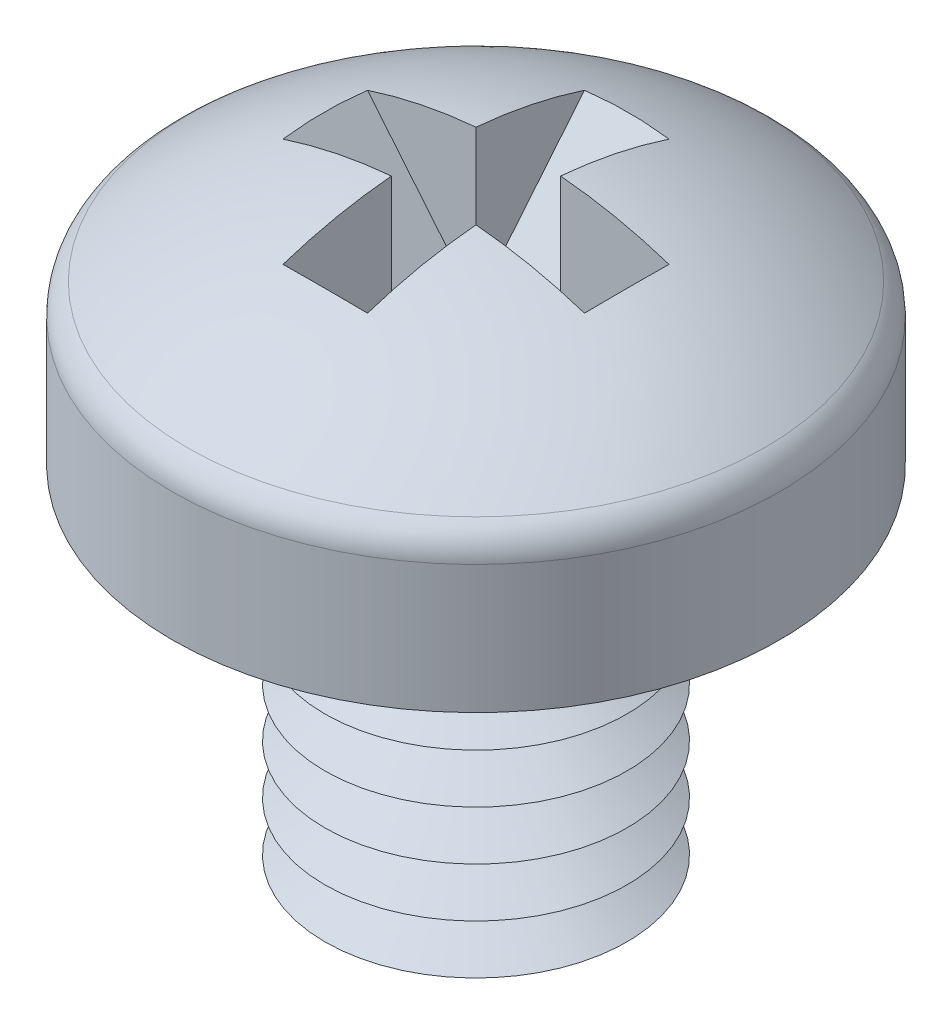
from build123d import *

# Parameters (mm, degrees)
CUT_EXTRUDE1_DEPTH = 0.35
CUT_EXTRUDE2_DEPTH = 0.35


with BuildPart() as part:
    # Sketch1 → Base-Revolve (revolve)
    with BuildSketch(Plane.XY, mode=Mode.PRIVATE) as base_revolve_sk:
        with BuildLine():
            Line((0, 0), (2.513235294, 0))
            Line((2.513235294, 0), (2.513235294, 1.061659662))
            ThreePointArc((2.513235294, 1.061659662), (2.47969251, 1.202686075), (2.386248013, 1.313508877))
            ThreePointArc((2.386248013, 1.313508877), (1.256259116, 1.898309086), (0, 2.1))
            Line((0, 2.1), (0, 0))
        make_face()
    revolve(base_revolve_sk.sketch.rotate(Axis((0, 0, 0), (0, 1, 0)), 90), axis=Axis((0, 0, 0), (0, 1, 0)))

    # Sketch2 → Boss-Revolve1 (revolve)
    with BuildSketch(Plane.XY, mode=Mode.PRIVATE) as boss_revolve1_sk:
        Polygon((0, -3), (0.8963675, -3), (1.25, -2.795830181), (0.8963675, -2.591660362), (1.25, -2.387490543), (0.8963675, -2.183320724), (1.25, -1.979150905), (0.8963675, -1.774981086), (1.25, -1.570811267), (0.8963675, -1.366641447), (1.25, -1.162471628), (0.8963675, -0.958301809), (1.25, -0.75413199), (0.8963675, -0.549962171), (1.25, -0.345792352), (0.8963675, -0.141622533), (1.25, -0.141622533), (1.25, 0), (0, 0), align=None)
    revolve(boss_revolve1_sk.sketch.rotate(Axis((0, 0, 0), (0, 1, 0)), 90), axis=Axis((0, 0, 0), (0, 1, 0)))

    # Sketch3 → Cut-Extrude1 (cut, symmetric)
    with BuildSketch(Plane.XY):
        Polygon((-1.425, 3.15), (1.425, 3.15), (1.425, 2.1), (0, 0.37), (-1.425, 2.1), align=None)
    extrude(amount=CUT_EXTRUDE1_DEPTH, both=True, mode=Mode.SUBTRACT)

    # Sketch4 → Cut-Extrude2 (cut, symmetric)
    with BuildSketch(Plane(origin=(0, 0, 0), x_dir=(0, 0, -1), z_dir=(1, 0, 0))):
        Polygon((-1.425, 3.15), (1.425, 3.15), (1.425, 2.1), (0, 0.37), (-1.425, 2.1), align=None)
    extrude(amount=CUT_EXTRUDE2_DEPTH, both=True, mode=Mode.SUBTRACT)


solid = part.part
